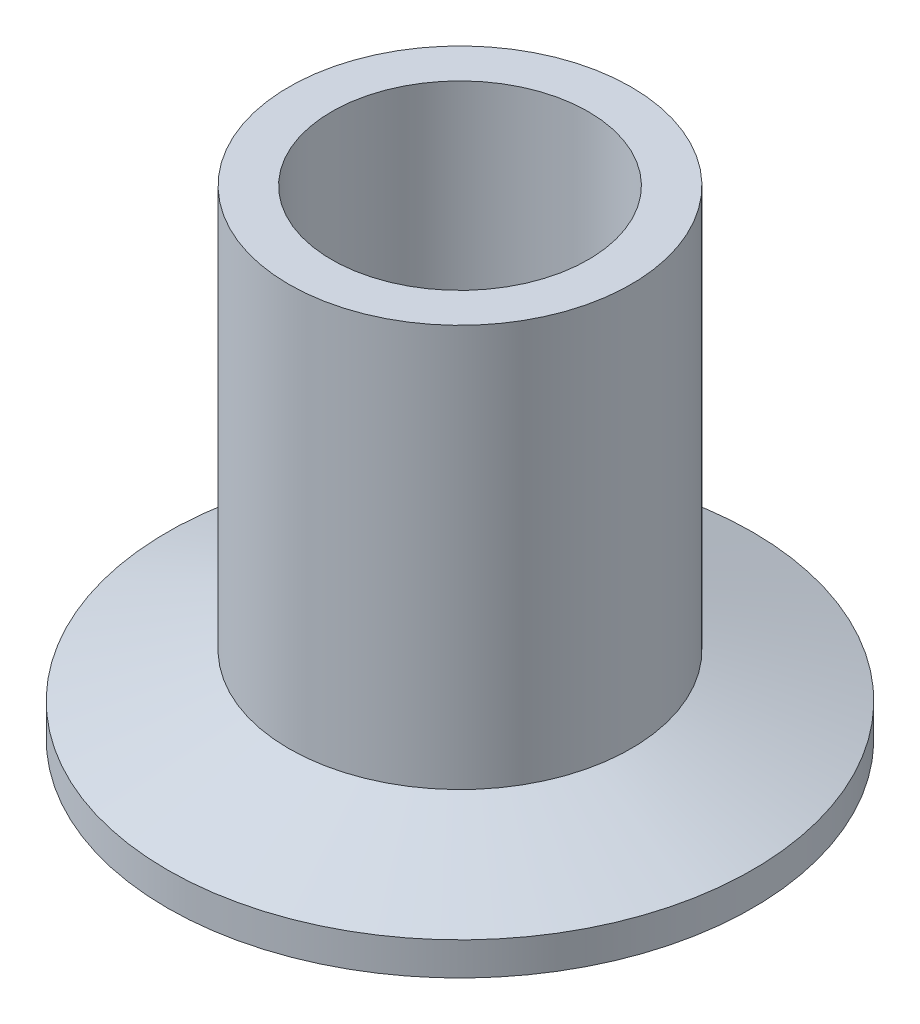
ISO-10303-21;
HEADER;
FILE_DESCRIPTION(('STEP AP214'),'2;1');
FILE_NAME('part.step','',(''),(''),'','','');
FILE_SCHEMA(('AUTOMOTIVE_DESIGN { 1 0 10303 214 1 1 1 1 }'));
ENDSEC;
DATA;
#1=APPLICATION_CONTEXT('core data for automotive mechanical design processes');
#2=APPLICATION_PROTOCOL_DEFINITION('international standard','automotive_design',2000,#1);
#3=PRODUCT_CONTEXT('',#1,'mechanical');
#4=PRODUCT('Part','Part','',(#3));
#5=PRODUCT_RELATED_PRODUCT_CATEGORY('part','',(#4));
#6=PRODUCT_DEFINITION_FORMATION('','',#4);
#7=PRODUCT_DEFINITION_CONTEXT('part definition',#1,'design');
#8=PRODUCT_DEFINITION('design','',#6,#7);
#9=PRODUCT_DEFINITION_SHAPE('','',#8);
#10=(LENGTH_UNIT() NAMED_UNIT(*) SI_UNIT(.MILLI.,.METRE.));
#11=(NAMED_UNIT(*) PLANE_ANGLE_UNIT() SI_UNIT($,.RADIAN.));
#12=(NAMED_UNIT(*) SI_UNIT($,.STERADIAN.) SOLID_ANGLE_UNIT());
#13=UNCERTAINTY_MEASURE_WITH_UNIT(LENGTH_MEASURE(1.E-05),#10,'distance_accuracy_value','');
#14=(GEOMETRIC_REPRESENTATION_CONTEXT(3) GLOBAL_UNCERTAINTY_ASSIGNED_CONTEXT((#13)) GLOBAL_UNIT_ASSIGNED_CONTEXT((#10,
#11,#12)) REPRESENTATION_CONTEXT('',''));
#15=CARTESIAN_POINT('',(0.,0.,0.));
#16=DIRECTION('',(0.,0.,1.));
#17=DIRECTION('',(1.,0.,0.));
#18=AXIS2_PLACEMENT_3D('',#15,#16,#17);
#19=CARTESIAN_POINT('',(0.,0.,0.));
#20=DIRECTION('',(0.,1.,0.));
#21=DIRECTION('',(0.,0.,1.));
#22=AXIS2_PLACEMENT_3D('',#19,#20,#21);
#23=PLANE('',#22);
#24=CARTESIAN_POINT('',(0.,0.,0.));
#25=DIRECTION('',(0.,-1.,0.));
#26=DIRECTION('',(0.,0.,-1.));
#27=AXIS2_PLACEMENT_3D('',#24,#25,#26);
#28=CIRCLE('',#27,23.6441393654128);
#29=CARTESIAN_POINT('',(0.,0.,-23.6441393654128));
#30=VERTEX_POINT('',#29);
#31=EDGE_CURVE('E10',#30,#30,#28,.T.);
#32=ORIENTED_EDGE('',*,*,#31,.F.);
#33=EDGE_LOOP('',(#32));
#34=FACE_BOUND('',#33,.T.);
#35=CARTESIAN_POINT('',(0.,0.,0.));
#36=DIRECTION('',(0.,-1.,0.));
#37=DIRECTION('',(0.,0.,-1.));
#38=AXIS2_PLACEMENT_3D('',#35,#36,#37);
#39=CIRCLE('',#38,25.1968);
#40=CARTESIAN_POINT('',(0.,0.,-25.1968));
#41=VERTEX_POINT('',#40);
#42=EDGE_CURVE('E88',#41,#41,#39,.T.);
#43=ORIENTED_EDGE('',*,*,#42,.T.);
#44=EDGE_LOOP('',(#43));
#45=FACE_BOUND('',#44,.T.);
#46=ADVANCED_FACE('F37',(#34,#45),#23,.F.);
#47=CARTESIAN_POINT('',(0.,0.508,0.));
#48=DIRECTION('',(0.,-1.,0.));
#49=DIRECTION('',(0.,0.,-1.));
#50=AXIS2_PLACEMENT_3D('',#47,#48,#49);
#51=TOROIDAL_SURFACE('',#50,23.6441393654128,0.507999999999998);
#52=CARTESIAN_POINT('',(0.,0.285307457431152,0.));
#53=DIRECTION('',(0.,-1.,0.));
#54=DIRECTION('',(0.,0.,-1.));
#55=AXIS2_PLACEMENT_3D('',#52,#53,#54);
#56=CIRCLE('',#55,23.1875519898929);
#57=CARTESIAN_POINT('',(0.,0.285307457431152,-23.1875519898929));
#58=VERTEX_POINT('',#57);
#59=EDGE_CURVE('E44',#58,#58,#56,.T.);
#60=ORIENTED_EDGE('',*,*,#59,.F.);
#61=EDGE_LOOP('',(#60));
#62=FACE_BOUND('',#61,.T.);
#63=ORIENTED_EDGE('',*,*,#31,.T.);
#64=EDGE_LOOP('',(#63));
#65=FACE_BOUND('',#64,.T.);
#66=ADVANCED_FACE('F130',(#62,#65),#51,.T.);
#67=CARTESIAN_POINT('',(0.,0.744846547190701,0.));
#68=DIRECTION('',(0.,-1.,0.));
#69=DIRECTION('',(0.,0.,-1.));
#70=AXIS2_PLACEMENT_3D('',#67,#68,#69);
#71=CONICAL_SURFACE('',#70,22.9634198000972,0.453785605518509);
#72=ORIENTED_EDGE('',*,*,#59,.T.);
#73=EDGE_LOOP('',(#72));
#74=FACE_BOUND('',#73,.T.);
#75=CARTESIAN_POINT('',(0.,0.744846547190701,0.));
#76=DIRECTION('',(0.,-1.,0.));
#77=DIRECTION('',(0.,0.,-1.));
#78=AXIS2_PLACEMENT_3D('',#75,#76,#77);
#79=CIRCLE('',#78,22.9634198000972);
#80=CARTESIAN_POINT('',(0.,0.744846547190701,-22.9634198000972));
#81=VERTEX_POINT('',#80);
#82=EDGE_CURVE('E51',#81,#81,#79,.T.);
#83=ORIENTED_EDGE('',*,*,#82,.F.);
#84=EDGE_LOOP('',(#83));
#85=FACE_BOUND('',#84,.T.);
#86=ADVANCED_FACE('F135',(#74,#85),#71,.F.);
#87=CARTESIAN_POINT('',(0.,0.4064,0.));
#88=DIRECTION('',(0.,-1.,0.));
#89=DIRECTION('',(0.,0.,-1.));
#90=AXIS2_PLACEMENT_3D('',#87,#88,#89);
#91=TOROIDAL_SURFACE('',#90,21.8186,1.1938);
#92=ORIENTED_EDGE('',*,*,#82,.T.);
#93=EDGE_LOOP('',(#92));
#94=FACE_BOUND('',#93,.T.);
#95=CARTESIAN_POINT('',(0.,0.814703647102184,0.));
#96=DIRECTION('',(0.,-1.,0.));
#97=DIRECTION('',(0.,0.,-1.));
#98=AXIS2_PLACEMENT_3D('',#95,#96,#97);
#99=CIRCLE('',#98,20.6967949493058);
#100=CARTESIAN_POINT('',(0.,0.814703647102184,-20.6967949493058));
#101=VERTEX_POINT('',#100);
#102=EDGE_CURVE('E57',#101,#101,#99,.T.);
#103=ORIENTED_EDGE('',*,*,#102,.F.);
#104=EDGE_LOOP('',(#103));
#105=FACE_BOUND('',#104,.T.);
#106=ADVANCED_FACE('F140',(#94,#105),#91,.F.);
#107=CARTESIAN_POINT('',(0.,0.334253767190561,0.));
#108=DIRECTION('',(0.,1.,0.));
#109=DIRECTION('',(0.,0.,1.));
#110=AXIS2_PLACEMENT_3D('',#107,#108,#109);
#111=CONICAL_SURFACE('',#110,20.5219254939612,0.349065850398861);
#112=ORIENTED_EDGE('',*,*,#102,.T.);
#113=EDGE_LOOP('',(#112));
#114=FACE_BOUND('',#113,.T.);
#115=CARTESIAN_POINT('',(0.,0.334253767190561,0.));
#116=DIRECTION('',(0.,-1.,0.));
#117=DIRECTION('',(0.,0.,-1.));
#118=AXIS2_PLACEMENT_3D('',#115,#116,#117);
#119=CIRCLE('',#118,20.5219254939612);
#120=CARTESIAN_POINT('',(0.,0.334253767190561,-20.5219254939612));
#121=VERTEX_POINT('',#120);
#122=EDGE_CURVE('E63',#121,#121,#119,.T.);
#123=ORIENTED_EDGE('',*,*,#122,.F.);
#124=EDGE_LOOP('',(#123));
#125=FACE_BOUND('',#124,.T.);
#126=ADVANCED_FACE('F145',(#114,#125),#111,.T.);
#127=CARTESIAN_POINT('',(0.,0.508,0.));
#128=DIRECTION('',(0.,-1.,0.));
#129=DIRECTION('',(0.,0.,-1.));
#130=AXIS2_PLACEMENT_3D('',#127,#128,#129);
#131=TOROIDAL_SURFACE('',#130,20.0445616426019,0.508);
#132=ORIENTED_EDGE('',*,*,#122,.T.);
#133=EDGE_LOOP('',(#132));
#134=FACE_BOUND('',#133,.T.);
#135=CARTESIAN_POINT('',(0.,0.,0.));
#136=DIRECTION('',(0.,-1.,0.));
#137=DIRECTION('',(0.,0.,-1.));
#138=AXIS2_PLACEMENT_3D('',#135,#136,#137);
#139=CIRCLE('',#138,20.0445616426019);
#140=CARTESIAN_POINT('',(0.,0.,-20.0445616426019));
#141=VERTEX_POINT('',#140);
#142=EDGE_CURVE('E66',#141,#141,#139,.T.);
#143=ORIENTED_EDGE('',*,*,#142,.F.);
#144=EDGE_LOOP('',(#143));
#145=FACE_BOUND('',#144,.T.);
#146=ADVANCED_FACE('F126',(#134,#145),#131,.T.);
#147=CARTESIAN_POINT('',(0.,0.,0.));
#148=DIRECTION('',(0.,1.,0.));
#149=DIRECTION('',(0.,0.,1.));
#150=AXIS2_PLACEMENT_3D('',#147,#148,#149);
#151=PLANE('',#150);
#152=CARTESIAN_POINT('',(0.,0.,0.));
#153=DIRECTION('',(0.,-1.,0.));
#154=DIRECTION('',(0.,0.,-1.));
#155=AXIS2_PLACEMENT_3D('',#152,#153,#154);
#156=CIRCLE('',#155,11.049);
#157=CARTESIAN_POINT('',(0.,0.,-11.049));
#158=VERTEX_POINT('',#157);
#159=EDGE_CURVE('E70',#158,#158,#156,.T.);
#160=ORIENTED_EDGE('',*,*,#159,.F.);
#161=EDGE_LOOP('',(#160));
#162=FACE_BOUND('',#161,.T.);
#163=ORIENTED_EDGE('',*,*,#142,.T.);
#164=EDGE_LOOP('',(#163));
#165=FACE_BOUND('',#164,.T.);
#166=ADVANCED_FACE('F120',(#162,#165),#151,.F.);
#167=CARTESIAN_POINT('',(0.,0.,0.));
#168=DIRECTION('',(0.,-1.,0.));
#169=DIRECTION('',(0.,0.,-1.));
#170=AXIS2_PLACEMENT_3D('',#167,#168,#169);
#171=CYLINDRICAL_SURFACE('',#170,11.049);
#172=ORIENTED_EDGE('',*,*,#159,.T.);
#173=EDGE_LOOP('',(#172));
#174=FACE_BOUND('',#173,.T.);
#175=CARTESIAN_POINT('',(0.,41.275,0.));
#176=DIRECTION('',(0.,-1.,0.));
#177=DIRECTION('',(0.,0.,-1.));
#178=AXIS2_PLACEMENT_3D('',#175,#176,#177);
#179=CIRCLE('',#178,11.049);
#180=CARTESIAN_POINT('',(0.,41.275,-11.049));
#181=VERTEX_POINT('',#180);
#182=EDGE_CURVE('E74',#181,#181,#179,.T.);
#183=ORIENTED_EDGE('',*,*,#182,.F.);
#184=EDGE_LOOP('',(#183));
#185=FACE_BOUND('',#184,.T.);
#186=ADVANCED_FACE('F115',(#174,#185),#171,.F.);
#187=CARTESIAN_POINT('',(0.,41.275,0.));
#188=DIRECTION('',(0.,-1.,0.));
#189=DIRECTION('',(0.,0.,-1.));
#190=AXIS2_PLACEMENT_3D('',#187,#188,#189);
#191=PLANE('',#190);
#192=CARTESIAN_POINT('',(0.,41.275,0.));
#193=DIRECTION('',(0.,-1.,0.));
#194=DIRECTION('',(0.,0.,-1.));
#195=AXIS2_PLACEMENT_3D('',#192,#193,#194);
#196=CIRCLE('',#195,14.732);
#197=CARTESIAN_POINT('',(0.,41.275,-14.732));
#198=VERTEX_POINT('',#197);
#199=EDGE_CURVE('E77',#198,#198,#196,.T.);
#200=ORIENTED_EDGE('',*,*,#199,.F.);
#201=EDGE_LOOP('',(#200));
#202=FACE_BOUND('',#201,.T.);
#203=ORIENTED_EDGE('',*,*,#182,.T.);
#204=EDGE_LOOP('',(#203));
#205=FACE_BOUND('',#204,.T.);
#206=ADVANCED_FACE('F109',(#202,#205),#191,.F.);
#207=CARTESIAN_POINT('',(0.,0.,0.));
#208=DIRECTION('',(0.,-1.,0.));
#209=DIRECTION('',(0.,0.,-1.));
#210=AXIS2_PLACEMENT_3D('',#207,#208,#209);
#211=CYLINDRICAL_SURFACE('',#210,14.732);
#212=CARTESIAN_POINT('',(0.,6.65367570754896,0.));
#213=DIRECTION('',(0.,-1.,0.));
#214=DIRECTION('',(0.,0.,-1.));
#215=AXIS2_PLACEMENT_3D('',#212,#213,#214);
#216=CIRCLE('',#215,14.732);
#217=CARTESIAN_POINT('',(0.,6.65367570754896,-14.732));
#218=VERTEX_POINT('',#217);
#219=EDGE_CURVE('E80',#218,#218,#216,.T.);
#220=ORIENTED_EDGE('',*,*,#219,.F.);
#221=EDGE_LOOP('',(#220));
#222=FACE_BOUND('',#221,.T.);
#223=ORIENTED_EDGE('',*,*,#199,.T.);
#224=EDGE_LOOP('',(#223));
#225=FACE_BOUND('',#224,.T.);
#226=ADVANCED_FACE('F103',(#222,#225),#211,.T.);
#227=CARTESIAN_POINT('',(0.,6.65367570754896,0.));
#228=DIRECTION('',(0.,-1.,0.));
#229=DIRECTION('',(0.,0.,-1.));
#230=AXIS2_PLACEMENT_3D('',#227,#228,#229);
#231=CONICAL_SURFACE('',#230,14.732,1.22173047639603);
#232=CARTESIAN_POINT('',(0.,2.8448,0.));
#233=DIRECTION('',(0.,-1.,0.));
#234=DIRECTION('',(0.,0.,-1.));
#235=AXIS2_PLACEMENT_3D('',#232,#233,#234);
#236=CIRCLE('',#235,25.1968);
#237=CARTESIAN_POINT('',(0.,2.8448,-25.1968));
#238=VERTEX_POINT('',#237);
#239=EDGE_CURVE('E84',#238,#238,#236,.T.);
#240=ORIENTED_EDGE('',*,*,#239,.F.);
#241=EDGE_LOOP('',(#240));
#242=FACE_BOUND('',#241,.T.);
#243=ORIENTED_EDGE('',*,*,#219,.T.);
#244=EDGE_LOOP('',(#243));
#245=FACE_BOUND('',#244,.T.);
#246=ADVANCED_FACE('F97',(#242,#245),#231,.T.);
#247=CARTESIAN_POINT('',(0.,0.,0.));
#248=DIRECTION('',(0.,-1.,0.));
#249=DIRECTION('',(0.,0.,-1.));
#250=AXIS2_PLACEMENT_3D('',#247,#248,#249);
#251=CYLINDRICAL_SURFACE('',#250,25.1968);
#252=ORIENTED_EDGE('',*,*,#42,.F.);
#253=EDGE_LOOP('',(#252));
#254=FACE_BOUND('',#253,.T.);
#255=ORIENTED_EDGE('',*,*,#239,.T.);
#256=EDGE_LOOP('',(#255));
#257=FACE_BOUND('',#256,.T.);
#258=ADVANCED_FACE('F94',(#254,#257),#251,.T.);
#259=CLOSED_SHELL('',(#46,#66,#86,#106,#126,#146,#166,#186,#206,#226,#246,#258));
#260=MANIFOLD_SOLID_BREP('B2',#259);
#261=ADVANCED_BREP_SHAPE_REPRESENTATION('',(#18,#260),#14);
#262=SHAPE_DEFINITION_REPRESENTATION(#9,#261);
ENDSEC;
END-ISO-10303-21;
